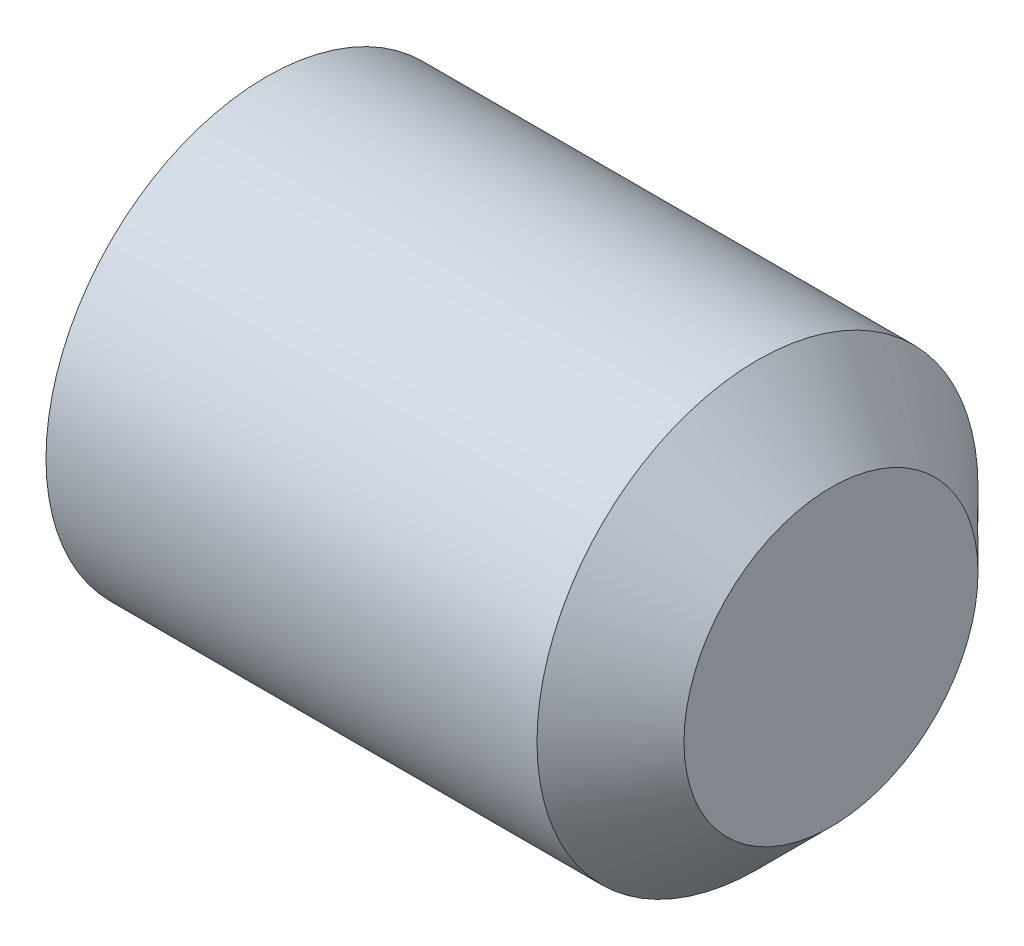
from build123d import *

# Parameters (mm, degrees)
HEX_2_DEPTH = 3.5


with BuildPart() as part:
    # BodySke → BaseBody (revolve)
    with BuildSketch(Plane.XY, mode=Mode.PRIVATE) as basebody_sk:
        Polygon((0, 0), (0, 2.4455), (0.320140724, 3), (7, 3), (8, 2), (8, 0), align=None)
    revolve(basebody_sk.sketch.rotate(Axis((-12.7, 0, 0), (1, 0, 0)), 90), axis=Axis((-12.7, 0, 0), (1, 0, 0)))

    # Sketch2 → Hex 2 (cut)
    with BuildSketch(Plane.ZY):
        Polygon((0.866025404, 1.5), (-0.866025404, 1.5), (-1.732050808, 0), (-0.866025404, -1.5), (0.866025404, -1.5), (1.732050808, 0), align=None)
    extrude(amount=-HEX_2_DEPTH, mode=Mode.SUBTRACT)


solid = part.part
